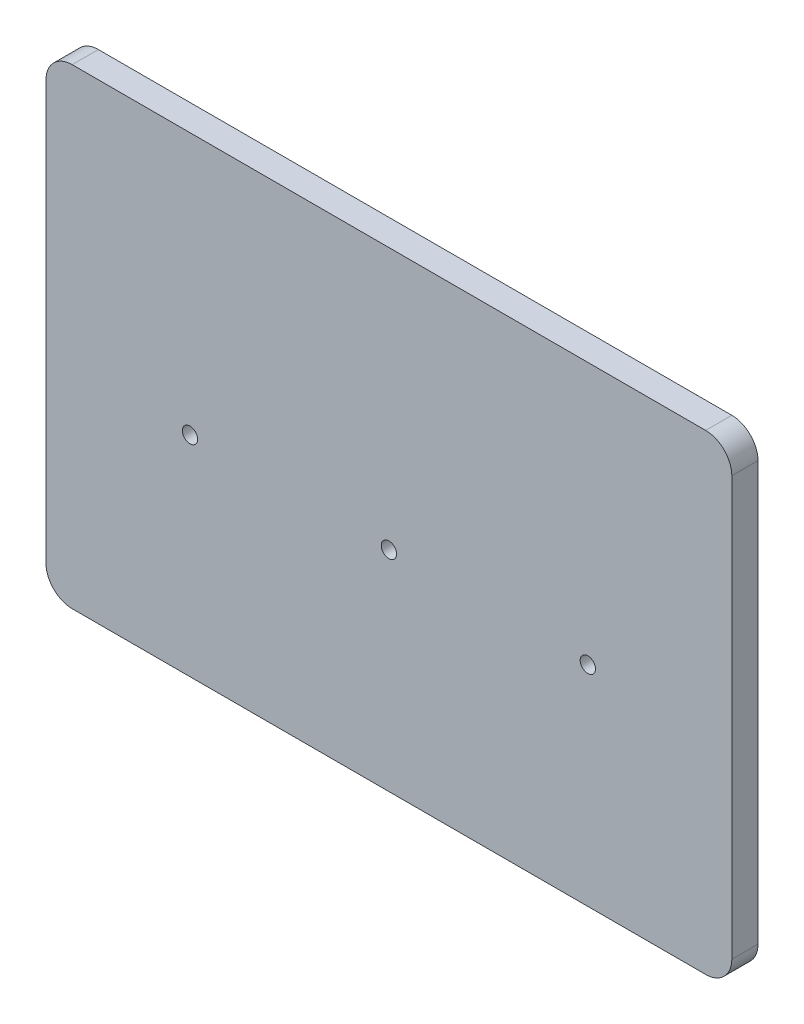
from build123d import *

# Parameters (mm, degrees)
ESQUISSE1_R      = 2.93
EXTRUSION1_DEPTH = 10


with BuildPart() as part:
    # Esquisse1 → Extrusion1 (new body)
    with BuildSketch(Plane.XY):
        with BuildLine():
            Line((-121, 100), (121, 100))
            ThreePointArc((121, 100), (128.071067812, 97.071067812), (131, 90))
            Line((131, 90), (131, -70))
            ThreePointArc((131, -70), (128.071067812, -77.071067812), (121, -80))
            Line((121, -80), (-121, -80))
            ThreePointArc((-121, -80), (-128.071067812, -77.071067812), (-131, -70))
            Line((-131, -70), (-131, 90))
            ThreePointArc((-131, 90), (-128.071067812, 97.071067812), (-121, 100))
        make_face()
        with Locations((-76, 0)):
            Circle(ESQUISSE1_R, mode=Mode.SUBTRACT)
        Circle(ESQUISSE1_R, mode=Mode.SUBTRACT)
        with Locations((76, 0)):
            Circle(ESQUISSE1_R, mode=Mode.SUBTRACT)
    extrude(amount=EXTRUSION1_DEPTH)


solid = part.part
